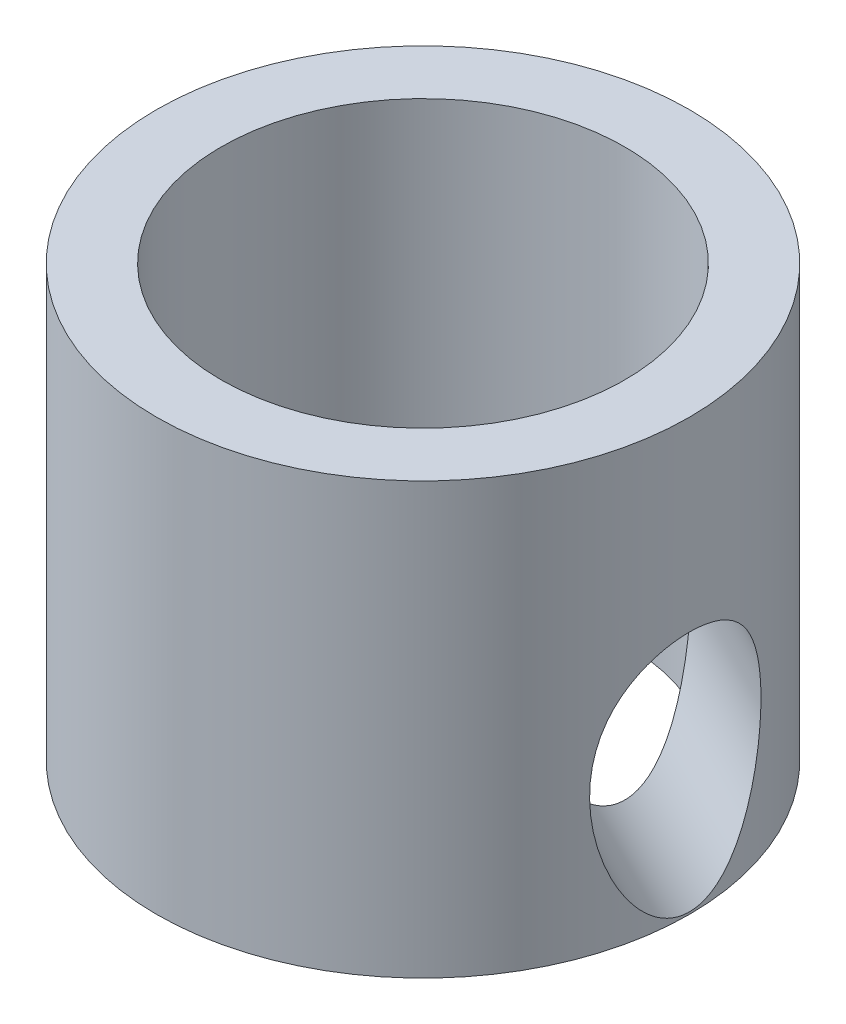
ISO-10303-21;
HEADER;
FILE_DESCRIPTION(('STEP AP214'),'2;1');
FILE_NAME('part.step','',(''),(''),'','','');
FILE_SCHEMA(('AUTOMOTIVE_DESIGN { 1 0 10303 214 1 1 1 1 }'));
ENDSEC;
DATA;
#1=APPLICATION_CONTEXT('core data for automotive mechanical design processes');
#2=APPLICATION_PROTOCOL_DEFINITION('international standard','automotive_design',2000,#1);
#3=PRODUCT_CONTEXT('',#1,'mechanical');
#4=PRODUCT('Part','Part','',(#3));
#5=PRODUCT_RELATED_PRODUCT_CATEGORY('part','',(#4));
#6=PRODUCT_DEFINITION_FORMATION('','',#4);
#7=PRODUCT_DEFINITION_CONTEXT('part definition',#1,'design');
#8=PRODUCT_DEFINITION('design','',#6,#7);
#9=PRODUCT_DEFINITION_SHAPE('','',#8);
#10=(LENGTH_UNIT() NAMED_UNIT(*) SI_UNIT(.MILLI.,.METRE.));
#11=(NAMED_UNIT(*) PLANE_ANGLE_UNIT() SI_UNIT($,.RADIAN.));
#12=(NAMED_UNIT(*) SI_UNIT($,.STERADIAN.) SOLID_ANGLE_UNIT());
#13=UNCERTAINTY_MEASURE_WITH_UNIT(LENGTH_MEASURE(1.E-05),#10,'distance_accuracy_value','');
#14=(GEOMETRIC_REPRESENTATION_CONTEXT(3) GLOBAL_UNCERTAINTY_ASSIGNED_CONTEXT((#13)) GLOBAL_UNIT_ASSIGNED_CONTEXT((#10,
#11,#12)) REPRESENTATION_CONTEXT('',''));
#15=CARTESIAN_POINT('',(0.,0.,0.));
#16=DIRECTION('',(0.,0.,1.));
#17=DIRECTION('',(1.,0.,0.));
#18=AXIS2_PLACEMENT_3D('',#15,#16,#17);
#19=CARTESIAN_POINT('',(0.,101.6,0.));
#20=DIRECTION('',(0.,1.,0.));
#21=DIRECTION('',(0.,0.,1.));
#22=AXIS2_PLACEMENT_3D('',#19,#20,#21);
#23=PLANE('',#22);
#24=CARTESIAN_POINT('',(0.,101.6,0.));
#25=DIRECTION('',(0.,1.,0.));
#26=DIRECTION('',(0.,0.,1.));
#27=AXIS2_PLACEMENT_3D('',#24,#25,#26);
#28=CIRCLE('',#27,62.865);
#29=CARTESIAN_POINT('',(0.,101.6,62.865));
#30=VERTEX_POINT('',#29);
#31=EDGE_CURVE('E10',#30,#30,#28,.T.);
#32=ORIENTED_EDGE('',*,*,#31,.T.);
#33=EDGE_LOOP('',(#32));
#34=FACE_BOUND('',#33,.T.);
#35=CARTESIAN_POINT('',(0.,101.6,0.));
#36=DIRECTION('',(0.,1.,0.));
#37=DIRECTION('',(0.,0.,1.));
#38=AXIS2_PLACEMENT_3D('',#35,#36,#37);
#39=CIRCLE('',#38,47.625);
#40=CARTESIAN_POINT('',(0.,101.6,47.625));
#41=VERTEX_POINT('',#40);
#42=EDGE_CURVE('E49',#41,#41,#39,.T.);
#43=ORIENTED_EDGE('',*,*,#42,.F.);
#44=EDGE_LOOP('',(#43));
#45=FACE_BOUND('',#44,.T.);
#46=ADVANCED_FACE('F31',(#34,#45),#23,.T.);
#47=CARTESIAN_POINT('',(0.,0.,0.));
#48=DIRECTION('',(0.,1.,0.));
#49=DIRECTION('',(0.,0.,1.));
#50=AXIS2_PLACEMENT_3D('',#47,#48,#49);
#51=PLANE('',#50);
#52=CARTESIAN_POINT('',(0.,0.,0.));
#53=DIRECTION('',(0.,1.,0.));
#54=DIRECTION('',(0.,0.,1.));
#55=AXIS2_PLACEMENT_3D('',#52,#53,#54);
#56=CIRCLE('',#55,62.865);
#57=CARTESIAN_POINT('',(0.,0.,62.865));
#58=VERTEX_POINT('',#57);
#59=EDGE_CURVE('E44',#58,#58,#56,.T.);
#60=ORIENTED_EDGE('',*,*,#59,.F.);
#61=EDGE_LOOP('',(#60));
#62=FACE_BOUND('',#61,.T.);
#63=CARTESIAN_POINT('',(0.,0.,0.));
#64=DIRECTION('',(0.,1.,0.));
#65=DIRECTION('',(0.,0.,1.));
#66=AXIS2_PLACEMENT_3D('',#63,#64,#65);
#67=CIRCLE('',#66,47.625);
#68=CARTESIAN_POINT('',(0.,0.,47.625));
#69=VERTEX_POINT('',#68);
#70=EDGE_CURVE('E51',#69,#69,#67,.T.);
#71=ORIENTED_EDGE('',*,*,#70,.T.);
#72=EDGE_LOOP('',(#71));
#73=FACE_BOUND('',#72,.T.);
#74=ADVANCED_FACE('F71',(#62,#73),#51,.F.);
#75=CARTESIAN_POINT('',(0.,101.6,0.));
#76=DIRECTION('',(0.,-1.,0.));
#77=DIRECTION('',(0.,0.,-1.));
#78=AXIS2_PLACEMENT_3D('',#75,#76,#77);
#79=CYLINDRICAL_SURFACE('',#78,62.865);
#80=CARTESIAN_POINT('',(62.865,57.709672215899,0.));
#81=CARTESIAN_POINT('',(62.864998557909,57.7096701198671,-0.508778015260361));
#82=CARTESIAN_POINT('',(62.8588081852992,57.6886728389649,-1.01760135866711));
#83=CARTESIAN_POINT('',(62.8342136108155,57.6048410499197,-2.03152503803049));
#84=CARTESIAN_POINT('',(62.8158079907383,57.5420016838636,-2.53662493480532));
#85=CARTESIAN_POINT('',(62.7672811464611,57.3749470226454,-3.53960934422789));
#86=CARTESIAN_POINT('',(62.7371544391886,57.2707123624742,-4.03749036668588));
#87=CARTESIAN_POINT('',(62.6660156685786,57.0217123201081,-5.02219102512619));
#88=CARTESIAN_POINT('',(62.6250039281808,56.8769481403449,-5.50901098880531));
#89=CARTESIAN_POINT('',(62.5332819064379,56.5483192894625,-6.46748212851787));
#90=CARTESIAN_POINT('',(62.4825864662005,56.3645144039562,-6.93915524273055));
#91=CARTESIAN_POINT('',(62.3728122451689,55.9591820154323,-7.86497636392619));
#92=CARTESIAN_POINT('',(62.313733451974,55.737654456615,-8.31912434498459));
#93=CARTESIAN_POINT('',(62.1887456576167,55.2587371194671,-9.20701601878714));
#94=CARTESIAN_POINT('',(62.1228375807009,55.0013521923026,-9.64076246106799));
#95=CARTESIAN_POINT('',(61.9858551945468,54.4528171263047,-10.4854711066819));
#96=CARTESIAN_POINT('',(61.9147808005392,54.1616664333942,-10.8964329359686));
#97=CARTESIAN_POINT('',(61.7673528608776,53.540199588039,-11.7036294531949));
#98=CARTESIAN_POINT('',(61.690911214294,53.209078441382,-12.0992278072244));
#99=CARTESIAN_POINT('',(61.5362748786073,52.5166141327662,-12.8626132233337));
#100=CARTESIAN_POINT('',(61.4580801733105,52.1552706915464,-13.2304000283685));
#101=CARTESIAN_POINT('',(61.3017084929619,51.4052474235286,-13.9369919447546));
#102=CARTESIAN_POINT('',(61.2235315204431,51.0165648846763,-14.2757941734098));
#103=CARTESIAN_POINT('',(61.0688347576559,50.2148486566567,-14.9236929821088));
#104=CARTESIAN_POINT('',(60.9923151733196,49.801811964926,-15.2327858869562));
#105=CARTESIAN_POINT('',(60.8348730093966,48.9118494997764,-15.8504903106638));
#106=CARTESIAN_POINT('',(60.7542791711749,48.4326718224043,-16.155940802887));
#107=CARTESIAN_POINT('',(60.5985185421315,47.4523212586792,-16.730703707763));
#108=CARTESIAN_POINT('',(60.5233519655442,46.9511475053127,-17.0000146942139));
#109=CARTESIAN_POINT('',(60.3797305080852,45.9302198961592,-17.5032829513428));
#110=CARTESIAN_POINT('',(60.3112782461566,45.410458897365,-17.7372264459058));
#111=CARTESIAN_POINT('',(60.1820957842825,44.3558212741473,-18.1707074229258));
#112=CARTESIAN_POINT('',(60.1213670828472,43.8209417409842,-18.3702382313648));
#113=CARTESIAN_POINT('',(59.9790287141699,42.458409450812,-18.8310813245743));
#114=CARTESIAN_POINT('',(59.902926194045,41.6227985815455,-19.0707591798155));
#115=CARTESIAN_POINT('',(59.771507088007,39.9326812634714,-19.4787274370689));
#116=CARTESIAN_POINT('',(59.716199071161,39.0781671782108,-19.646988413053));
#117=CARTESIAN_POINT('',(59.6265063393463,37.356025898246,-19.9175356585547));
#118=CARTESIAN_POINT('',(59.5921644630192,36.4883755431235,-20.0196868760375));
#119=CARTESIAN_POINT('',(59.5440437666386,34.74754663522,-20.1623587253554));
#120=CARTESIAN_POINT('',(59.5302648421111,33.8743681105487,-20.2028796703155));
#121=CARTESIAN_POINT('',(59.5235371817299,32.4139709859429,-20.2226741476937));
#122=CARTESIAN_POINT('',(59.5252378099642,31.826915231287,-20.2176795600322));
#123=CARTESIAN_POINT('',(59.5370443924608,30.6535712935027,-20.1828879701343));
#124=CARTESIAN_POINT('',(59.5471509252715,30.0672831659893,-20.1530892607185));
#125=CARTESIAN_POINT('',(59.5753364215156,28.8964184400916,-20.0696146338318));
#126=CARTESIAN_POINT('',(59.5934181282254,28.3118425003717,-20.0159305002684));
#127=CARTESIAN_POINT('',(59.6370827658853,27.1455763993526,-19.8854548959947));
#128=CARTESIAN_POINT('',(59.6626655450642,26.5638861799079,-19.8086638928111));
#129=CARTESIAN_POINT('',(59.7208790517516,25.4035361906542,-19.6324590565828));
#130=CARTESIAN_POINT('',(59.7535188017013,24.8248812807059,-19.5330162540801));
#131=CARTESIAN_POINT('',(59.8253194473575,23.672223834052,-19.3119878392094));
#132=CARTESIAN_POINT('',(59.8644804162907,23.0982213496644,-19.1904019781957));
#133=CARTESIAN_POINT('',(59.94879468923,21.9558818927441,-18.9253691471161));
#134=CARTESIAN_POINT('',(59.9939463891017,21.3875434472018,-18.7819280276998));
#135=CARTESIAN_POINT('',(60.0897128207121,20.257343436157,-18.4732419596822));
#136=CARTESIAN_POINT('',(60.1403273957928,19.6954816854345,-18.3079976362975));
#137=CARTESIAN_POINT('',(60.2836485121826,18.1883317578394,-17.8322291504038));
#138=CARTESIAN_POINT('',(60.3810240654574,17.2498763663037,-17.5009615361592));
#139=CARTESIAN_POINT('',(60.5356435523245,15.8624713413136,-16.9552228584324));
#140=CARTESIAN_POINT('',(60.5886209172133,15.4032924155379,-16.7651272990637));
#141=CARTESIAN_POINT('',(60.6970507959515,14.492527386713,-16.3682205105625));
#142=CARTESIAN_POINT('',(60.7525030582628,14.0409405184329,-16.1614109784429));
#143=CARTESIAN_POINT('',(60.8653277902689,13.1475481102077,-15.7311605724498));
#144=CARTESIAN_POINT('',(60.9226945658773,12.7057191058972,-15.5077669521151));
#145=CARTESIAN_POINT('',(61.0390552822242,11.8317467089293,-15.0432473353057));
#146=CARTESIAN_POINT('',(61.0980490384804,11.3996022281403,-14.8021233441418));
#147=CARTESIAN_POINT('',(61.2171581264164,10.5465815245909,-14.3015361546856));
#148=CARTESIAN_POINT('',(61.2772727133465,10.1256982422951,-14.0420848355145));
#149=CARTESIAN_POINT('',(61.3981381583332,9.29650538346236,-13.5038126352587));
#150=CARTESIAN_POINT('',(61.45888908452,8.88819717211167,-13.2249896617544));
#151=CARTESIAN_POINT('',(61.5842756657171,8.06075515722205,-12.6286921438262));
#152=CARTESIAN_POINT('',(61.6489134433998,7.64257598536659,-12.3098878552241));
#153=CARTESIAN_POINT('',(61.7773712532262,6.82579303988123,-11.6480992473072));
#154=CARTESIAN_POINT('',(61.8411915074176,6.42718386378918,-11.305121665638));
#155=CARTESIAN_POINT('',(61.9670283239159,5.6532026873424,-10.5936820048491));
#156=CARTESIAN_POINT('',(62.0290453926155,5.2778241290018,-10.2252271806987));
#157=CARTESIAN_POINT('',(62.1501161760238,4.55479023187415,-9.46153822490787));
#158=CARTESIAN_POINT('',(62.2091704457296,4.20712969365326,-9.06630914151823));
#159=CARTESIAN_POINT('',(62.3115453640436,3.61135905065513,-8.32998580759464));
#160=CARTESIAN_POINT('',(62.3556512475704,3.35724186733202,-7.99386476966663));
#161=CARTESIAN_POINT('',(62.4402484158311,2.87377288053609,-7.30372743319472));
#162=CARTESIAN_POINT('',(62.4807397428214,2.64442078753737,-6.9497113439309));
#163=CARTESIAN_POINT('',(62.557135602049,2.21466658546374,-6.22460569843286));
#164=CARTESIAN_POINT('',(62.5930461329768,2.0142265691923,-5.85353935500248));
#165=CARTESIAN_POINT('',(62.6593520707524,1.64619618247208,-5.09496028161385));
#166=CARTESIAN_POINT('',(62.6897488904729,1.47859739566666,-4.70745179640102));
#167=CARTESIAN_POINT('',(62.7384931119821,1.21098241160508,-3.99861021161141));
#168=CARTESIAN_POINT('',(62.7580335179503,1.10415435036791,-3.67992513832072));
#169=CARTESIAN_POINT('',(62.7925311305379,0.916046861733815,-3.03488062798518));
#170=CARTESIAN_POINT('',(62.8074893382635,0.834761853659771,-2.70852288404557));
#171=CARTESIAN_POINT('',(62.8324225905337,0.699503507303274,-2.05019864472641));
#172=CARTESIAN_POINT('',(62.8424007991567,0.645512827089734,-1.71823584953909));
#173=CARTESIAN_POINT('',(62.8571038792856,0.566020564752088,-1.0507754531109));
#174=CARTESIAN_POINT('',(62.8618286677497,0.540519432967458,-0.715277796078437));
#175=CARTESIAN_POINT('',(62.8658875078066,0.518610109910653,-0.0425386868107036));
#176=CARTESIAN_POINT('',(62.8652093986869,0.522267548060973,0.294704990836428));
#177=CARTESIAN_POINT('',(62.8584543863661,0.558738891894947,0.967540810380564));
#178=CARTESIAN_POINT('',(62.8523775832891,0.591552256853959,1.30313298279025));
#179=CARTESIAN_POINT('',(62.8350013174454,0.685561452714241,1.9703491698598));
#180=CARTESIAN_POINT('',(62.8236989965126,0.7467728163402,2.30197091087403));
#181=CARTESIAN_POINT('',(62.7961900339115,0.896175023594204,2.95886362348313));
#182=CARTESIAN_POINT('',(62.7799828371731,0.984368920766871,3.28413387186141));
#183=CARTESIAN_POINT('',(62.7393557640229,1.2062525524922,3.99135473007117));
#184=CARTESIAN_POINT('',(62.713938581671,1.345531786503,4.37149752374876));
#185=CARTESIAN_POINT('',(62.6574620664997,1.65675363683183,5.11769630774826));
#186=CARTESIAN_POINT('',(62.6264016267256,1.82870266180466,5.48374951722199));
#187=CARTESIAN_POINT('',(62.5594810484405,2.20166875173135,6.20075643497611));
#188=CARTESIAN_POINT('',(62.5236152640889,2.40272003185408,6.55169173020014));
#189=CARTESIAN_POINT('',(62.4479571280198,2.83013892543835,7.2373979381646));
#190=CARTESIAN_POINT('',(62.40816344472,3.05651512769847,7.57216331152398));
#191=CARTESIAN_POINT('',(62.3055241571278,3.64556283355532,8.38259211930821));
#192=CARTESIAN_POINT('',(62.2408046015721,4.02137860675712,8.84848887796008));
#193=CARTESIAN_POINT('',(62.1067300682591,4.81205165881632,9.74515309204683));
#194=CARTESIAN_POINT('',(62.0373728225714,5.22692808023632,10.1759031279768));
#195=CARTESIAN_POINT('',(61.8957507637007,6.08914252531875,11.0046015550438));
#196=CARTESIAN_POINT('',(61.8234806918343,6.53654054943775,11.402486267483));
#197=CARTESIAN_POINT('',(61.677681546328,7.45733932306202,12.1664726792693));
#198=CARTESIAN_POINT('',(61.6041525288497,7.93073891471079,12.5325757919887));
#199=CARTESIAN_POINT('',(61.4704281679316,8.8112502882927,13.1712130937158));
#200=CARTESIAN_POINT('',(61.4102331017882,9.21481325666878,13.4486752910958));
#201=CARTESIAN_POINT('',(61.2904132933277,10.0345082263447,13.9845941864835));
#202=CARTESIAN_POINT('',(61.2307886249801,10.4506418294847,14.2430484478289));
#203=CARTESIAN_POINT('',(61.1126070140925,11.2940224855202,14.7418863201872));
#204=CARTESIAN_POINT('',(61.0540506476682,11.7212752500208,14.9822603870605));
#205=CARTESIAN_POINT('',(60.9385037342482,12.5853295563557,15.4455159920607));
#206=CARTESIAN_POINT('',(60.881513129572,13.0221307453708,15.6683981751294));
#207=CARTESIAN_POINT('',(60.7694502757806,13.904705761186,16.0975584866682));
#208=CARTESIAN_POINT('',(60.7143804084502,14.3504897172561,16.3038163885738));
#209=CARTESIAN_POINT('',(60.6066197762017,15.2495805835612,16.6999381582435));
#210=CARTESIAN_POINT('',(60.5539292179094,15.7028881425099,16.8898006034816));
#211=CARTESIAN_POINT('',(60.4000166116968,17.0725435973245,17.4352923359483));
#212=CARTESIAN_POINT('',(60.3029065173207,17.9989918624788,17.7670033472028));
#213=CARTESIAN_POINT('',(60.1172562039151,19.9267897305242,18.3856952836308));
#214=CARTESIAN_POINT('',(60.0295281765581,20.929385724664,18.6690144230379));
#215=CARTESIAN_POINT('',(59.8724570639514,22.9531020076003,19.1667733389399));
#216=CARTESIAN_POINT('',(59.8031162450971,23.9742245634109,19.3812046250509));
#217=CARTESIAN_POINT('',(59.6857920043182,26.0292054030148,19.7395533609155));
#218=CARTESIAN_POINT('',(59.6377922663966,27.0630533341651,19.8835246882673));
#219=CARTESIAN_POINT('',(59.5658619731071,29.1391375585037,20.0979924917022));
#220=CARTESIAN_POINT('',(59.5419272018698,30.1813723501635,20.1685018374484));
#221=CARTESIAN_POINT('',(59.5222483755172,32.1130683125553,20.2264865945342));
#222=CARTESIAN_POINT('',(59.5228372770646,33.002169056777,20.2247628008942));
#223=CARTESIAN_POINT('',(59.544616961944,34.7780829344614,20.1605592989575));
#224=CARTESIAN_POINT('',(59.5658081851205,35.6648960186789,20.0980782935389));
#225=CARTESIAN_POINT('',(59.6297015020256,37.4299031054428,19.9077134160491));
#226=CARTESIAN_POINT('',(59.6723817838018,38.3081049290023,19.7798958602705));
#227=CARTESIAN_POINT('',(59.7795609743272,40.0499404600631,19.4535881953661));
#228=CARTESIAN_POINT('',(59.8440536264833,40.9135782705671,19.2551183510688));
#229=CARTESIAN_POINT('',(59.9765437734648,42.4174707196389,18.837676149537));
#230=CARTESIAN_POINT('',(60.0401532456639,43.0625110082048,18.6344917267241));
#231=CARTESIAN_POINT('',(60.1789645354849,44.3346970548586,18.1812198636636));
#232=CARTESIAN_POINT('',(60.2541655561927,44.9618440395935,17.9311356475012));
#233=CARTESIAN_POINT('',(60.4147715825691,46.1924532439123,17.3823250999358));
#234=CARTESIAN_POINT('',(60.5001663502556,46.7959384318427,17.0836474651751));
#235=CARTESIAN_POINT('',(60.6792994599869,47.9740672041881,16.4360477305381));
#236=CARTESIAN_POINT('',(60.7730365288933,48.548715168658,16.0871332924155));
#237=CARTESIAN_POINT('',(60.9509072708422,49.5742682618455,15.3980733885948));
#238=CARTESIAN_POINT('',(61.0341974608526,50.0303189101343,15.0653578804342));
#239=CARTESIAN_POINT('',(61.2029900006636,50.913723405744,14.3642683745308));
#240=CARTESIAN_POINT('',(61.2884921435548,51.341079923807,13.9958977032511));
#241=CARTESIAN_POINT('',(61.4595866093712,52.1632215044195,13.2243532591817));
#242=CARTESIAN_POINT('',(61.545178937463,52.5580045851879,12.8211773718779));
#243=CARTESIAN_POINT('',(61.7141152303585,53.3111484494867,11.9816309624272));
#244=CARTESIAN_POINT('',(61.797459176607,53.6695089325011,11.5452601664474));
#245=CARTESIAN_POINT('',(61.9598811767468,54.3479630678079,10.6392752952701));
#246=CARTESIAN_POINT('',(62.0389346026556,54.6678464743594,10.1694990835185));
#247=CARTESIAN_POINT('',(62.1898320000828,55.2638377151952,9.20177987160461));
#248=CARTESIAN_POINT('',(62.2616755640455,55.5399430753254,8.70383528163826));
#249=CARTESIAN_POINT('',(62.3957498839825,56.0452537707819,7.6839400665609));
#250=CARTESIAN_POINT('',(62.457988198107,56.2744960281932,7.16200874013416));
#251=CARTESIAN_POINT('',(62.5708181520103,56.6839195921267,6.09809996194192));
#252=CARTESIAN_POINT('',(62.6214125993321,56.864112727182,5.55612737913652));
#253=CARTESIAN_POINT('',(62.6977593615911,57.1331630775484,4.60057606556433));
#254=CARTESIAN_POINT('',(62.7265484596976,57.2335832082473,4.19045207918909));
#255=CARTESIAN_POINT('',(62.7763023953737,57.4061279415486,3.36383989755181));
#256=CARTESIAN_POINT('',(62.7972680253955,57.4782554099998,2.94735235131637));
#257=CARTESIAN_POINT('',(62.8309710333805,57.5938038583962,2.11016196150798));
#258=CARTESIAN_POINT('',(62.8437098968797,57.63723002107,1.68945989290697));
#259=CARTESIAN_POINT('',(62.8607256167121,57.6951672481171,0.845849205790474));
#260=CARTESIAN_POINT('',(62.8650011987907,57.709673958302,0.422940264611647));
#261=CARTESIAN_POINT('',(62.865,57.709672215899,0.));
#262=B_SPLINE_CURVE_WITH_KNOTS('',3,(#80,#81,#82,#83,#84,#85,#86,#87,#88,#89,#90,#91,#92,#93,
#94,#95,#96,#97,#98,#99,#100,#101,#102,#103,#104,#105,#106,#107,#108,#109,#110,#111,#112,#113,
#114,#115,#116,#117,#118,#119,#120,#121,#122,#123,#124,#125,#126,#127,#128,#129,#130,#131,#132,
#133,#134,#135,#136,#137,#138,#139,#140,#141,#142,#143,#144,#145,#146,#147,#148,#149,#150,#151,
#152,#153,#154,#155,#156,#157,#158,#159,#160,#161,#162,#163,#164,#165,#166,#167,#168,#169,#170,
#171,#172,#173,#174,#175,#176,#177,#178,#179,#180,#181,#182,#183,#184,#185,#186,#187,#188,#189,
#190,#191,#192,#193,#194,#195,#196,#197,#198,#199,#200,#201,#202,#203,#204,#205,#206,#207,#208,
#209,#210,#211,#212,#213,#214,#215,#216,#217,#218,#219,#220,#221,#222,#223,#224,#225,#226,#227,
#228,#229,#230,#231,#232,#233,#234,#235,#236,#237,#238,#239,#240,#241,#242,#243,#244,#245,#246,
#247,#248,#249,#250,#251,#252,#253,#254,#255,#256,#257,#258,#259,#260,#261),.UNSPECIFIED.,.T.,
.F.,(4,2,2,2,2,2,2,2,2,2,2,2,2,2,2,2,2,2,2,2,2,2,2,2,2,2,2,2,2,2,2,2,2,2,2,2,2,2,2,2,2,2,2,2,2,
2,2,2,2,2,2,2,2,2,2,2,2,2,2,2,2,2,2,2,2,2,2,2,2,2,2,2,2,2,2,2,2,2,2,2,2,2,2,2,2,2,2,2,2,2,4),
(0.,1.52594333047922,3.05206385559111,4.5788991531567,6.10568915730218,7.63015773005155,
9.15462855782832,10.6788933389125,12.2031831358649,13.7660668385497,15.3289649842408,
16.8920183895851,18.4552649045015,20.1753861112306,21.8955751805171,23.6164325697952,
25.3376233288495,27.9515575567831,30.5665677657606,33.1869033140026,35.8072255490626,
37.5679207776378,39.3287371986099,41.0901597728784,42.8515467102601,44.6151990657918,
46.3788712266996,48.1420720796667,49.9052223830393,52.9022236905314,54.4013271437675,
55.9002785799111,57.395111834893,58.8897762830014,60.3834806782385,61.8773466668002,
63.4659148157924,65.0540419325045,66.6417186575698,68.2290968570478,69.4991366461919,
70.7691615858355,72.0375059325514,73.3055248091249,74.3145749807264,75.3234045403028,
76.3315923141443,77.3397960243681,78.3502696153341,79.3607244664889,80.3717326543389,
81.3828552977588,82.5980205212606,83.8134243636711,85.0302689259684,86.2475274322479,
88.0508713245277,89.8551036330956,91.6627535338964,93.4703230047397,94.9500721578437,
96.4300106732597,97.9107250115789,99.391384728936,100.873819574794,102.35638291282,
105.320279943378,108.454353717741,111.588813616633,114.720872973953,117.852383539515,
120.517596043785,123.18286544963,125.845434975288,128.507241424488,130.543304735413,
132.579228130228,134.613123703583,136.646709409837,138.356888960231,140.066909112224,
141.77703322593,143.487171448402,145.206266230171,146.925458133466,148.64329026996,
150.36070777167,151.629370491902,152.897904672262,154.166209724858,155.434705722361),.UNSPECIFIED.);
#263=CARTESIAN_POINT('',(62.865,57.709672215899,0.));
#264=VERTEX_POINT('',#263);
#265=EDGE_CURVE('E54',#264,#264,#262,.T.);
#266=ORIENTED_EDGE('',*,*,#265,.T.);
#267=EDGE_LOOP('',(#266));
#268=FACE_BOUND('',#267,.T.);
#269=ORIENTED_EDGE('',*,*,#31,.F.);
#270=EDGE_LOOP('',(#269));
#271=FACE_BOUND('',#270,.T.);
#272=ORIENTED_EDGE('',*,*,#59,.T.);
#273=EDGE_LOOP('',(#272));
#274=FACE_BOUND('',#273,.T.);
#275=ADVANCED_FACE('F33',(#268,#271,#274),#79,.T.);
#276=CARTESIAN_POINT('',(0.,101.6,0.));
#277=DIRECTION('',(0.,-1.,0.));
#278=DIRECTION('',(0.,0.,-1.));
#279=AXIS2_PLACEMENT_3D('',#276,#277,#278);
#280=CYLINDRICAL_SURFACE('',#279,47.625);
#281=CARTESIAN_POINT('',(47.625,72.9496722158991,0.));
#282=CARTESIAN_POINT('',(47.6250052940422,72.9496757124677,-0.528297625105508));
#283=CARTESIAN_POINT('',(47.6161940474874,72.9291781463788,-1.05651282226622));
#284=CARTESIAN_POINT('',(47.5811789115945,72.8472601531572,-2.10934908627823));
#285=CARTESIAN_POINT('',(47.5549709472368,72.7858301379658,-2.63396928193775));
#286=CARTESIAN_POINT('',(47.485779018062,72.6221808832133,-3.67620872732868));
#287=CARTESIAN_POINT('',(47.4427785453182,72.5199215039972,-4.19382056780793));
#288=CARTESIAN_POINT('',(47.341101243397,72.2750282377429,-5.21780161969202));
#289=CARTESIAN_POINT('',(47.2824253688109,72.1323968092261,-5.72417151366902));
#290=CARTESIAN_POINT('',(47.1509304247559,71.8074482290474,-6.72186454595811));
#291=CARTESIAN_POINT('',(47.0781178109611,71.6251491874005,-7.2131944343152));
#292=CARTESIAN_POINT('',(46.9202127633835,71.2216973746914,-8.17759337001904));
#293=CARTESIAN_POINT('',(46.835120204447,71.0005442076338,-8.65066223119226));
#294=CARTESIAN_POINT('',(46.6549014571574,70.5206504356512,-9.57509838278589));
#295=CARTESIAN_POINT('',(46.5597790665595,70.2619240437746,-10.0264737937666));
#296=CARTESIAN_POINT('',(46.3619471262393,69.7083409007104,-10.9047302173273));
#297=CARTESIAN_POINT('',(46.2592376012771,69.4134842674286,-11.3316113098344));
#298=CARTESIAN_POINT('',(46.0485662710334,68.7885993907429,-12.1594901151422));
#299=CARTESIAN_POINT('',(45.9405897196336,68.4584689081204,-12.5604068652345));
#300=CARTESIAN_POINT('',(45.722415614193,67.7660534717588,-13.3327573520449));
#301=CARTESIAN_POINT('',(45.6122180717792,67.4037686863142,-13.7041912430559));
#302=CARTESIAN_POINT('',(45.3923040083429,66.649680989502,-14.4158987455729));
#303=CARTESIAN_POINT('',(45.2825874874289,66.2578780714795,-14.7561723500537));
#304=CARTESIAN_POINT('',(45.066175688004,65.4476727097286,-15.4044558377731));
#305=CARTESIAN_POINT('',(44.9594805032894,65.0292694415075,-15.7124647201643));
#306=CARTESIAN_POINT('',(44.746948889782,64.1506048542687,-16.3081412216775));
#307=CARTESIAN_POINT('',(44.6413436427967,63.689319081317,-16.5943787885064));
#308=CARTESIAN_POINT('',(44.4380899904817,62.7448450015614,-17.1312346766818));
#309=CARTESIAN_POINT('',(44.3404416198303,62.261656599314,-17.3818528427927));
#310=CARTESIAN_POINT('',(44.1547956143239,61.2767801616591,-17.8481838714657));
#311=CARTESIAN_POINT('',(44.0668012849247,60.7750858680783,-18.0638847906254));
#312=CARTESIAN_POINT('',(43.9017381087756,59.7566125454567,-18.4614294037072));
#313=CARTESIAN_POINT('',(43.8246716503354,59.2398302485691,-18.6432656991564));
#314=CARTESIAN_POINT('',(43.7012957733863,58.33394502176,-18.9302607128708));
#315=CARTESIAN_POINT('',(43.6522661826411,57.9475635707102,-19.0429334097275));
#316=CARTESIAN_POINT('',(43.5607070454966,57.1696264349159,-19.2514500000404));
#317=CARTESIAN_POINT('',(43.5181762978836,56.7780717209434,-19.3472970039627));
#318=CARTESIAN_POINT('',(43.400440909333,55.5967472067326,-19.6107104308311));
#319=CARTESIAN_POINT('',(43.3351157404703,54.8004832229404,-19.7540974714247));
#320=CARTESIAN_POINT('',(43.2305015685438,53.1968217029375,-19.9819868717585));
#321=CARTESIAN_POINT('',(43.1912564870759,52.3894077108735,-20.0663899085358));
#322=CARTESIAN_POINT('',(43.1377197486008,50.7699826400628,-20.1812232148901));
#323=CARTESIAN_POINT('',(43.1234283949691,49.9579715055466,-20.2116528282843));
#324=CARTESIAN_POINT('',(43.118788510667,48.5603521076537,-20.2215353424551));
#325=CARTESIAN_POINT('',(43.1228722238,47.9747874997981,-20.212842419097));
#326=CARTESIAN_POINT('',(43.1423369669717,46.8046487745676,-20.1712656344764));
#327=CARTESIAN_POINT('',(43.1577190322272,46.2200747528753,-20.1383795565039));
#328=CARTESIAN_POINT('',(43.1990061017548,45.0528274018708,-20.0496600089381));
#329=CARTESIAN_POINT('',(43.224915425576,44.4701549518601,-19.9938171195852));
#330=CARTESIAN_POINT('',(43.2864578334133,43.3078698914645,-19.8602265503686));
#331=CARTESIAN_POINT('',(43.3220906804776,42.7282572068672,-19.7824794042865));
#332=CARTESIAN_POINT('',(43.4024334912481,41.5707875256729,-19.6055823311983));
#333=CARTESIAN_POINT('',(43.447175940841,40.9929445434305,-19.5063557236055));
#334=CARTESIAN_POINT('',(43.5448705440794,39.8418842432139,-19.2872822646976));
#335=CARTESIAN_POINT('',(43.5978227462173,39.2686669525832,-19.1674352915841));
#336=CARTESIAN_POINT('',(43.7111537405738,38.1277214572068,-18.90755814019));
#337=CARTESIAN_POINT('',(43.7715306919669,37.5599919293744,-18.7675329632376));
#338=CARTESIAN_POINT('',(43.8989704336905,36.4306046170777,-18.4674738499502));
#339=CARTESIAN_POINT('',(43.9660332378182,35.8689468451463,-18.3074398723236));
#340=CARTESIAN_POINT('',(44.1086042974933,34.7325669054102,-17.9612900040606));
#341=CARTESIAN_POINT('',(44.1843284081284,34.158092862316,-17.7744476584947));
#342=CARTESIAN_POINT('',(44.3413441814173,33.017425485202,-17.3790413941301));
#343=CARTESIAN_POINT('',(44.422635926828,32.4512322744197,-17.1704771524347));
#344=CARTESIAN_POINT('',(44.5900208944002,31.3278716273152,-16.7309892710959));
#345=CARTESIAN_POINT('',(44.676117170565,30.7707102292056,-16.5000513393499));
#346=CARTESIAN_POINT('',(44.85221773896,29.6671153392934,-16.0151719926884));
#347=CARTESIAN_POINT('',(44.9422219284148,29.12068156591,-15.7612311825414));
#348=CARTESIAN_POINT('',(45.1246929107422,28.0434352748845,-15.2309186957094));
#349=CARTESIAN_POINT('',(45.2171413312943,27.5125477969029,-14.9546933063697));
#350=CARTESIAN_POINT('',(45.4040864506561,26.4648667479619,-14.3771251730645));
#351=CARTESIAN_POINT('',(45.4985833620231,25.9480746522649,-14.0757798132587));
#352=CARTESIAN_POINT('',(45.6884273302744,24.9318495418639,-13.4467851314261));
#353=CARTESIAN_POINT('',(45.7837730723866,24.4323941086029,-13.1191717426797));
#354=CARTESIAN_POINT('',(45.9741959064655,23.4534783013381,-12.435429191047));
#355=CARTESIAN_POINT('',(46.069273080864,22.9740109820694,-12.0793100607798));
#356=CARTESIAN_POINT('',(46.2321744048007,22.1659221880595,-11.436985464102));
#357=CARTESIAN_POINT('',(46.3003999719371,21.8316411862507,-11.1579951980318));
#358=CARTESIAN_POINT('',(46.4352708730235,21.177985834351,-10.582700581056));
#359=CARTESIAN_POINT('',(46.5019163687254,20.8586099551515,-10.2863980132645));
#360=CARTESIAN_POINT('',(46.6329254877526,20.2369148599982,-9.6751583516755));
#361=CARTESIAN_POINT('',(46.6972864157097,19.9346155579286,-9.36020034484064));
#362=CARTESIAN_POINT('',(46.8227236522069,19.3505632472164,-8.71105353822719));
#363=CARTESIAN_POINT('',(46.8837998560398,19.0688108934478,-8.37686412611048));
#364=CARTESIAN_POINT('',(47.002328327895,18.5261877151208,-7.68418982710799));
#365=CARTESIAN_POINT('',(47.0597245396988,18.2656285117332,-7.3254497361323));
#366=CARTESIAN_POINT('',(47.1687211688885,17.7740781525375,-6.58722503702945));
#367=CARTESIAN_POINT('',(47.2203210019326,17.5430899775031,-6.20773834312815));
#368=CARTESIAN_POINT('',(47.3161064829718,17.116624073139,-5.42954568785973));
#369=CARTESIAN_POINT('',(47.360310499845,16.9210582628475,-5.03089060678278));
#370=CARTESIAN_POINT('',(47.4398546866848,16.5706076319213,-4.21525350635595));
#371=CARTESIAN_POINT('',(47.4751996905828,16.4157006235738,-3.79828162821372));
#372=CARTESIAN_POINT('',(47.5263279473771,16.1922658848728,-3.07840941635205));
#373=CARTESIAN_POINT('',(47.5447914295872,16.1117951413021,-2.77937336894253));
#374=CARTESIAN_POINT('',(47.5762414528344,15.9749251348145,-2.17558409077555));
#375=CARTESIAN_POINT('',(47.5892293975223,15.9185197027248,-1.87083234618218));
#376=CARTESIAN_POINT('',(47.6093781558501,15.8310854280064,-1.25768490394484));
#377=CARTESIAN_POINT('',(47.6165423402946,15.8000419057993,-0.949291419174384));
#378=CARTESIAN_POINT('',(47.6248543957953,15.7640290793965,-0.330883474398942));
#379=CARTESIAN_POINT('',(47.6260020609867,15.7590606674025,-0.0208689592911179));
#380=CARTESIAN_POINT('',(47.6222459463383,15.7753303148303,0.598581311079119));
#381=CARTESIAN_POINT('',(47.6173392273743,15.7965811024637,0.908016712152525));
#382=CARTESIAN_POINT('',(47.6016108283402,15.8647823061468,1.52386533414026));
#383=CARTESIAN_POINT('',(47.5907892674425,15.91173220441,1.83027861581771));
#384=CARTESIAN_POINT('',(47.5635192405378,16.0302635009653,2.43821906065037));
#385=CARTESIAN_POINT('',(47.5470673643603,16.1018598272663,2.73974314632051));
#386=CARTESIAN_POINT('',(47.508954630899,16.2681310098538,3.33604342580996));
#387=CARTESIAN_POINT('',(47.4872925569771,16.3628112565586,3.63081802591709));
#388=CARTESIAN_POINT('',(47.4320886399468,16.6048351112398,4.29894203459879));
#389=CARTESIAN_POINT('',(47.3969302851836,16.7594644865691,4.66953138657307));
#390=CARTESIAN_POINT('',(47.3198360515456,17.1002355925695,5.39509353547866));
#391=CARTESIAN_POINT('',(47.2778982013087,17.2863864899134,5.75006175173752));
#392=CARTESIAN_POINT('',(47.1435217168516,17.8864026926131,6.79110036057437));
#393=CARTESIAN_POINT('',(47.0425855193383,18.3415482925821,7.45256316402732));
#394=CARTESIAN_POINT('',(46.8498799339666,19.2243886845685,8.57198490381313));
#395=CARTESIAN_POINT('',(46.7608546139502,19.6367047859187,9.04300399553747));
#396=CARTESIAN_POINT('',(46.5769609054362,20.5005327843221,9.94685366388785));
#397=CARTESIAN_POINT('',(46.4820891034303,20.9520676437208,10.3796615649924));
#398=CARTESIAN_POINT('',(46.2888206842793,21.8869369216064,11.210169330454));
#399=CARTESIAN_POINT('',(46.1904176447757,22.3703307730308,11.6078001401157));
#400=CARTESIAN_POINT('',(45.9922000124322,23.3621654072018,12.3698457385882));
#401=CARTESIAN_POINT('',(45.8923855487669,23.870603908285,12.7342635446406));
#402=CARTESIAN_POINT('',(45.706518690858,24.8373403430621,13.3848045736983));
#403=CARTESIAN_POINT('',(45.6204448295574,25.2930269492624,13.6748293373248));
#404=CARTESIAN_POINT('',(45.4492670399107,26.2176156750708,14.2334146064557));
#405=CARTESIAN_POINT('',(45.3641632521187,26.6865196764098,14.5019720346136));
#406=CARTESIAN_POINT('',(45.1956557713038,27.6359692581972,15.0188964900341));
#407=CARTESIAN_POINT('',(45.1122531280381,28.1165216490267,15.2672513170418));
#408=CARTESIAN_POINT('',(44.9478983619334,29.0875398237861,15.7445466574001));
#409=CARTESIAN_POINT('',(44.8669461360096,29.5780051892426,15.9734879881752));
#410=CARTESIAN_POINT('',(44.7079779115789,30.5686689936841,16.4131679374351));
#411=CARTESIAN_POINT('',(44.6299680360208,31.0688847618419,16.6238696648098));
#412=CARTESIAN_POINT('',(44.4776720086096,32.0771239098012,17.0271479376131));
#413=CARTESIAN_POINT('',(44.4033858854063,32.5851473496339,17.2197243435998));
#414=CARTESIAN_POINT('',(44.2591588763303,33.6080235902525,17.5871091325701));
#415=CARTESIAN_POINT('',(44.1892168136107,34.1228744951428,17.7619223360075));
#416=CARTESIAN_POINT('',(44.0542495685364,35.1588183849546,18.0940833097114));
#417=CARTESIAN_POINT('',(43.9892244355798,35.6799114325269,18.2514309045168));
#418=CARTESIAN_POINT('',(43.8607866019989,36.7605027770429,18.5580537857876));
#419=CARTESIAN_POINT('',(43.797729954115,37.3203623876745,18.7062062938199));
#420=CARTESIAN_POINT('',(43.6785655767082,38.4456735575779,18.9827870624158));
#421=CARTESIAN_POINT('',(43.6224579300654,39.0111251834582,19.1112150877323));
#422=CARTESIAN_POINT('',(43.5179176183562,40.1470690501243,19.3480809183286));
#423=CARTESIAN_POINT('',(43.4694870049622,40.7175625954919,19.4565133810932));
#424=CARTESIAN_POINT('',(43.3810768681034,41.862724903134,19.6528468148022));
#425=CARTESIAN_POINT('',(43.3410972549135,42.4373936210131,19.7407480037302));
#426=CARTESIAN_POINT('',(43.2704449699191,43.5888083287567,19.8951354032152));
#427=CARTESIAN_POINT('',(43.2397507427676,44.1655463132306,19.9616712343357));
#428=CARTESIAN_POINT('',(43.1883209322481,45.3216150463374,20.0727005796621));
#429=CARTESIAN_POINT('',(43.1675856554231,45.9009458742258,20.1171934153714));
#430=CARTESIAN_POINT('',(43.1368598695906,47.0609573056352,20.1829949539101));
#431=CARTESIAN_POINT('',(43.1268642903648,47.6416371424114,20.2043145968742));
#432=CARTESIAN_POINT('',(43.1183543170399,48.8034043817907,20.2224682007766));
#433=CARTESIAN_POINT('',(43.1198386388,49.3844917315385,20.219304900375));
#434=CARTESIAN_POINT('',(43.1371796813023,50.7131237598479,20.1822967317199));
#435=CARTESIAN_POINT('',(43.157052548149,51.460410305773,20.1398779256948));
#436=CARTESIAN_POINT('',(43.2183032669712,52.9499734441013,20.0081034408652));
#437=CARTESIAN_POINT('',(43.2596794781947,53.6922504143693,19.918751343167));
#438=CARTESIAN_POINT('',(43.3647037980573,55.1665155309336,19.6890600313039));
#439=CARTESIAN_POINT('',(43.4283261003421,55.8985145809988,19.5487798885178));
#440=CARTESIAN_POINT('',(43.5779740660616,57.3474307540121,19.212879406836));
#441=CARTESIAN_POINT('',(43.6639958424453,58.0643504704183,19.0172686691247));
#442=CARTESIAN_POINT('',(43.8405339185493,59.3524636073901,18.6061511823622));
#443=CARTESIAN_POINT('',(43.9276162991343,59.9271639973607,18.4001499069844));
#444=CARTESIAN_POINT('',(44.1151910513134,61.0573483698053,17.9457793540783));
#445=CARTESIAN_POINT('',(44.2156821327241,61.612834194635,17.6974141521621));
#446=CARTESIAN_POINT('',(44.4281807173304,62.699710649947,17.1569697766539));
#447=CARTESIAN_POINT('',(44.5401851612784,63.2311076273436,16.8649022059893));
#448=CARTESIAN_POINT('',(44.7731314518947,64.2649829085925,16.2363662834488));
#449=CARTESIAN_POINT('',(44.8940733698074,64.7674609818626,15.8998975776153));
#450=CARTESIAN_POINT('',(45.1424386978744,65.7417686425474,15.1804659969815));
#451=CARTESIAN_POINT('',(45.2699002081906,66.2133695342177,14.7972058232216));
#452=CARTESIAN_POINT('',(45.5266251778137,67.1173744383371,13.9873990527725));
#453=CARTESIAN_POINT('',(45.6558886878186,67.5497773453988,13.5608512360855));
#454=CARTESIAN_POINT('',(45.9119306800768,68.3710517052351,12.6669385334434));
#455=CARTESIAN_POINT('',(46.0387089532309,68.7599195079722,12.1995702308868));
#456=CARTESIAN_POINT('',(46.2853503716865,69.4903427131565,11.2275629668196));
#457=CARTESIAN_POINT('',(46.405214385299,69.8319040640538,10.7229287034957));
#458=CARTESIAN_POINT('',(46.6206014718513,70.4282843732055,9.74079139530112));
#459=CARTESIAN_POINT('',(46.7173379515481,70.6885630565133,9.26685848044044));
#460=CARTESIAN_POINT('',(46.8993668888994,71.1681874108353,8.29660002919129));
#461=CARTESIAN_POINT('',(46.9846595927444,71.3875339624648,7.80027497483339));
#462=CARTESIAN_POINT('',(47.1413155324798,71.7838214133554,6.78956077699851));
#463=CARTESIAN_POINT('',(47.2126956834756,71.9608138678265,6.27519447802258));
#464=CARTESIAN_POINT('',(47.3396655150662,72.2718155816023,5.23191166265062));
#465=CARTESIAN_POINT('',(47.3952591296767,72.4058355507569,4.70299880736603));
#466=CARTESIAN_POINT('',(47.5022172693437,72.6616232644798,3.48562201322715));
#467=CARTESIAN_POINT('',(47.548097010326,72.769596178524,2.79372765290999));
#468=CARTESIAN_POINT('',(47.609484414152,72.9136172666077,1.40117371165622));
#469=CARTESIAN_POINT('',(47.6249929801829,72.9496675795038,0.700514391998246));
#470=CARTESIAN_POINT('',(47.625,72.9496722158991,0.));
#471=B_SPLINE_CURVE_WITH_KNOTS('',3,(#281,#282,#283,#284,#285,#286,#287,#288,#289,#290,#291,
#292,#293,#294,#295,#296,#297,#298,#299,#300,#301,#302,#303,#304,#305,#306,#307,#308,#309,#310,
#311,#312,#313,#314,#315,#316,#317,#318,#319,#320,#321,#322,#323,#324,#325,#326,#327,#328,#329,
#330,#331,#332,#333,#334,#335,#336,#337,#338,#339,#340,#341,#342,#343,#344,#345,#346,#347,#348,
#349,#350,#351,#352,#353,#354,#355,#356,#357,#358,#359,#360,#361,#362,#363,#364,#365,#366,#367,
#368,#369,#370,#371,#372,#373,#374,#375,#376,#377,#378,#379,#380,#381,#382,#383,#384,#385,#386,
#387,#388,#389,#390,#391,#392,#393,#394,#395,#396,#397,#398,#399,#400,#401,#402,#403,#404,#405,
#406,#407,#408,#409,#410,#411,#412,#413,#414,#415,#416,#417,#418,#419,#420,#421,#422,#423,#424,
#425,#426,#427,#428,#429,#430,#431,#432,#433,#434,#435,#436,#437,#438,#439,#440,#441,#442,#443,
#444,#445,#446,#447,#448,#449,#450,#451,#452,#453,#454,#455,#456,#457,#458,#459,#460,#461,#462,
#463,#464,#465,#466,#467,#468,#469,#470),.UNSPECIFIED.,.T.,.F.,(4,2,2,2,2,2,2,2,2,2,2,2,2,2,2,2,
2,2,2,2,2,2,2,2,2,2,2,2,2,2,2,2,2,2,2,2,2,2,2,2,2,2,2,2,2,2,2,2,2,2,2,2,2,2,2,2,2,2,2,2,2,2,2,2,
2,2,2,2,2,2,2,2,2,2,2,2,2,2,2,2,2,2,2,2,2,2,2,2,2,2,2,2,2,2,4),(0.,1.58428007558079,
3.16893138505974,4.75514442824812,6.34126089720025,7.92665474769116,9.51206475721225,
11.0968765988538,12.6816832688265,14.2712148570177,15.8607381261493,17.4502617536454,
19.0398346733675,20.6972786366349,22.354729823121,24.0127467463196,25.6711254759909,
26.887041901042,28.1027333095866,30.5346408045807,32.970633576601,35.4066559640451,
37.1630034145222,38.919511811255,40.6767416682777,42.4339287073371,44.1974954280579,
45.9610725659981,47.7242133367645,49.48735774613,51.3133613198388,53.1393920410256,
54.9665970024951,56.7937539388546,58.6097645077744,60.4259644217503,62.239720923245,
64.0528418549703,65.3744883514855,66.695998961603,68.019020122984,69.3420834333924,
70.6819959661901,72.0220434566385,73.3587116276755,74.6946488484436,75.6243925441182,
76.5538977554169,77.4828645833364,78.4118631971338,79.3413129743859,80.2707440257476,
81.200739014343,82.130951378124,83.3383496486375,84.5460996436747,86.963959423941,
88.8585223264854,90.7542020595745,92.6535241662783,94.5526735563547,96.1929715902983,
97.8335043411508,99.475020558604,101.116467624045,102.761160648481,104.40586632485,
106.050124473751,107.694399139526,109.441655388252,111.188932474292,112.936675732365,
114.684400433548,116.428036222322,118.171725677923,119.914591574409,121.657262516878,
123.901824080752,126.146214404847,128.388009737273,130.629416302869,132.477737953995,
134.325881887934,136.173536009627,138.021204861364,139.881292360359,141.741432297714,
143.601728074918,145.461789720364,147.107600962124,148.753376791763,150.397139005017,
152.040491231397,154.141284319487,156.242014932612),.UNSPECIFIED.);
#472=CARTESIAN_POINT('',(47.625,72.9496722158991,0.));
#473=VERTEX_POINT('',#472);
#474=EDGE_CURVE('E36',#473,#473,#471,.T.);
#475=ORIENTED_EDGE('',*,*,#474,.F.);
#476=EDGE_LOOP('',(#475));
#477=FACE_BOUND('',#476,.T.);
#478=ORIENTED_EDGE('',*,*,#42,.T.);
#479=EDGE_LOOP('',(#478));
#480=FACE_BOUND('',#479,.T.);
#481=ORIENTED_EDGE('',*,*,#70,.F.);
#482=EDGE_LOOP('',(#481));
#483=FACE_BOUND('',#482,.T.);
#484=ADVANCED_FACE('F63',(#477,#480,#483),#280,.F.);
#485=CARTESIAN_POINT('',(8.98025612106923,83.0012806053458,0.));
#486=DIRECTION('',(0.707106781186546,-0.707106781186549,0.));
#487=DIRECTION('',(0.707106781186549,0.707106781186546,0.));
#488=AXIS2_PLACEMENT_3D('',#485,#486,#487);
#489=CYLINDRICAL_SURFACE('',#488,20.2184);
#490=ORIENTED_EDGE('',*,*,#474,.T.);
#491=EDGE_LOOP('',(#490));
#492=FACE_BOUND('',#491,.T.);
#493=ORIENTED_EDGE('',*,*,#265,.F.);
#494=EDGE_LOOP('',(#493));
#495=FACE_BOUND('',#494,.T.);
#496=ADVANCED_FACE('F60',(#492,#495),#489,.F.);
#497=CLOSED_SHELL('',(#46,#74,#275,#484,#496));
#498=MANIFOLD_SOLID_BREP('B2',#497);
#499=ADVANCED_BREP_SHAPE_REPRESENTATION('',(#18,#498),#14);
#500=SHAPE_DEFINITION_REPRESENTATION(#9,#499);
ENDSEC;
END-ISO-10303-21;
